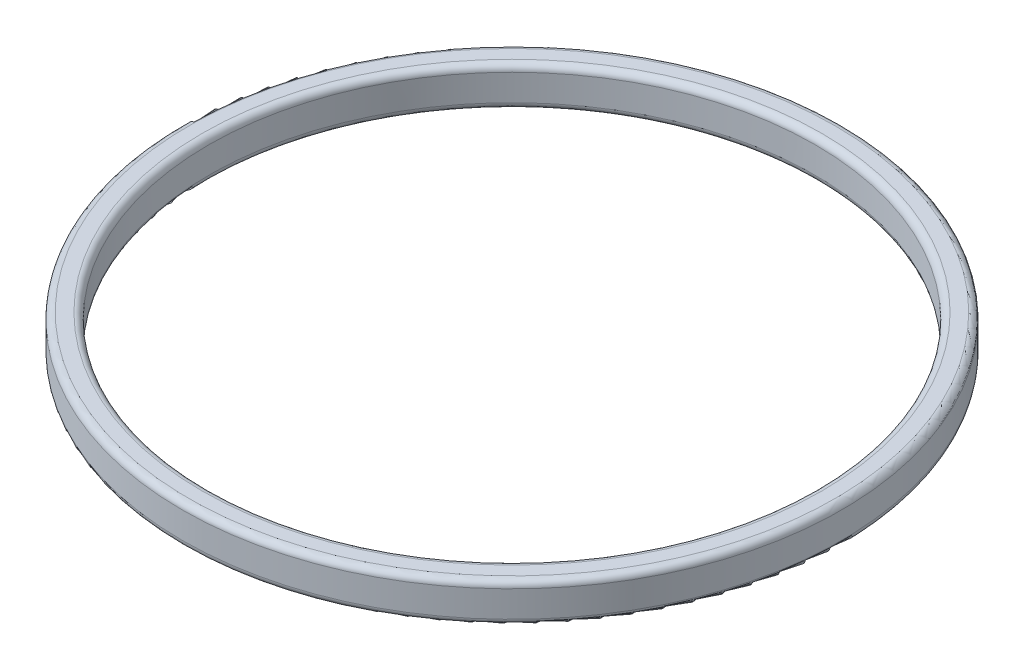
from build123d import *

# Parameters (mm, degrees)
ESQUISSE1_W = 1
ESQUISSE1_H = 1.5
CONG_1_R    = 0.25


with BuildPart() as part:
    # Esquisse1 → Base-R_volution (revolve)
    with BuildSketch(Plane.XY, mode=Mode.PRIVATE) as base_r_volution_sk:
        with Locations((12, 0.75)):
            Rectangle(ESQUISSE1_W, ESQUISSE1_H)
    revolve(base_r_volution_sk.sketch.rotate(Axis((0, 20, 0), (0, -1, 0)), 90), axis=Axis((0, 20, 0), (0, -1, 0)))

    # Cong_1
    cong_1_edges = [part.edges().sort_by_distance(p)[0] for p in [
        (0, 0, -11.5),
        (0, 0, -12.5),
        (0, 1.5, -12.5),
        (0, 1.5, -11.5),
    ]]
    fillet(cong_1_edges, radius=CONG_1_R)


solid = part.part
